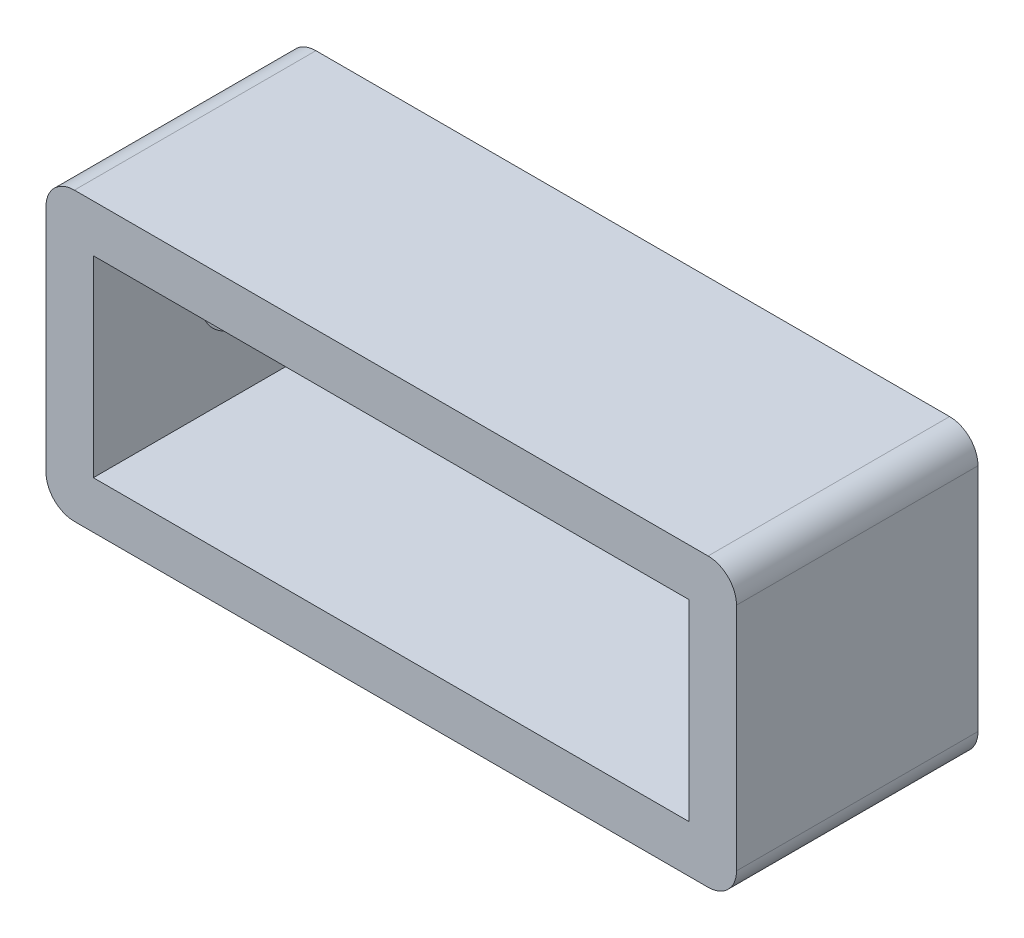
ISO-10303-21;
HEADER;
FILE_DESCRIPTION(('STEP AP214'),'2;1');
FILE_NAME('part.step','',(''),(''),'','','');
FILE_SCHEMA(('AUTOMOTIVE_DESIGN { 1 0 10303 214 1 1 1 1 }'));
ENDSEC;
DATA;
#1=APPLICATION_CONTEXT('core data for automotive mechanical design processes');
#2=APPLICATION_PROTOCOL_DEFINITION('international standard','automotive_design',2000,#1);
#3=PRODUCT_CONTEXT('',#1,'mechanical');
#4=PRODUCT('Part','Part','',(#3));
#5=PRODUCT_RELATED_PRODUCT_CATEGORY('part','',(#4));
#6=PRODUCT_DEFINITION_FORMATION('','',#4);
#7=PRODUCT_DEFINITION_CONTEXT('part definition',#1,'design');
#8=PRODUCT_DEFINITION('design','',#6,#7);
#9=PRODUCT_DEFINITION_SHAPE('','',#8);
#10=(LENGTH_UNIT() NAMED_UNIT(*) SI_UNIT(.MILLI.,.METRE.));
#11=(NAMED_UNIT(*) PLANE_ANGLE_UNIT() SI_UNIT($,.RADIAN.));
#12=(NAMED_UNIT(*) SI_UNIT($,.STERADIAN.) SOLID_ANGLE_UNIT());
#13=UNCERTAINTY_MEASURE_WITH_UNIT(LENGTH_MEASURE(1.E-05),#10,'distance_accuracy_value','');
#14=(GEOMETRIC_REPRESENTATION_CONTEXT(3) GLOBAL_UNCERTAINTY_ASSIGNED_CONTEXT((#13)) GLOBAL_UNIT_ASSIGNED_CONTEXT((#10,
#11,#12)) REPRESENTATION_CONTEXT('',''));
#15=CARTESIAN_POINT('',(0.,0.,0.));
#16=DIRECTION('',(0.,0.,1.));
#17=DIRECTION('',(1.,0.,0.));
#18=AXIS2_PLACEMENT_3D('',#15,#16,#17);
#19=CARTESIAN_POINT('',(33.985001,10.3,-21.));
#20=DIRECTION('',(0.,-1.,0.));
#21=DIRECTION('',(0.,0.,-1.));
#22=AXIS2_PLACEMENT_3D('',#19,#20,#21);
#23=PLANE('',#22);
#24=DIRECTION('',(0.,0.,1.));
#25=VECTOR('',#24,1.);
#26=CARTESIAN_POINT('',(31.985001,10.3,-21.));
#27=LINE('',#26,#25);
#28=CARTESIAN_POINT('',(31.985001,10.3,-24.));
#29=VERTEX_POINT('',#28);
#30=CARTESIAN_POINT('',(31.985001,10.3,0.));
#31=VERTEX_POINT('',#30);
#32=EDGE_CURVE('E221',#29,#31,#27,.T.);
#33=ORIENTED_EDGE('',*,*,#32,.T.);
#34=DIRECTION('',(1.,0.,0.));
#35=VECTOR('',#34,1.);
#36=CARTESIAN_POINT('',(33.985001,10.3,0.));
#37=LINE('',#36,#35);
#38=CARTESIAN_POINT('',(-30.9265875,10.3,0.));
#39=VERTEX_POINT('',#38);
#40=EDGE_CURVE('E226',#39,#31,#37,.T.);
#41=ORIENTED_EDGE('',*,*,#40,.F.);
#42=DIRECTION('',(0.,0.,1.));
#43=VECTOR('',#42,1.);
#44=CARTESIAN_POINT('',(-30.9265875,10.3,-21.));
#45=LINE('',#44,#43);
#46=CARTESIAN_POINT('',(-30.9265875,10.3,-24.));
#47=VERTEX_POINT('',#46);
#48=EDGE_CURVE('E218',#47,#39,#45,.T.);
#49=ORIENTED_EDGE('',*,*,#48,.F.);
#50=DIRECTION('',(1.,0.,0.));
#51=VECTOR('',#50,1.);
#52=CARTESIAN_POINT('',(-30.9265875,10.3,-24.));
#53=LINE('',#52,#51);
#54=EDGE_CURVE('E197',#47,#29,#53,.T.);
#55=ORIENTED_EDGE('',*,*,#54,.T.);
#56=EDGE_LOOP('',(#33,#41,#49,#55));
#57=FACE_BOUND('',#56,.T.);
#58=ADVANCED_FACE('F35',(#57),#23,.T.);
#59=CARTESIAN_POINT('',(31.985001,-58.9988552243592,3.));
#60=DIRECTION('',(1.,0.,0.));
#61=DIRECTION('',(0.,1.,0.));
#62=AXIS2_PLACEMENT_3D('',#59,#60,#61);
#63=PLANE('',#62);
#64=DIRECTION('',(0.,0.,1.));
#65=VECTOR('',#64,1.);
#66=CARTESIAN_POINT('',(31.985001,-10.,-21.));
#67=LINE('',#66,#65);
#68=CARTESIAN_POINT('',(31.985001,-10.,-24.));
#69=VERTEX_POINT('',#68);
#70=CARTESIAN_POINT('',(31.985001,-9.99999999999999,0.));
#71=VERTEX_POINT('',#70);
#72=EDGE_CURVE('E224',#69,#71,#67,.T.);
#73=ORIENTED_EDGE('',*,*,#72,.T.);
#74=DIRECTION('',(0.,1.,0.));
#75=VECTOR('',#74,1.);
#76=CARTESIAN_POINT('',(31.985001,-58.9988552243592,0.));
#77=LINE('',#76,#75);
#78=EDGE_CURVE('E59',#71,#31,#77,.T.);
#79=ORIENTED_EDGE('',*,*,#78,.T.);
#80=ORIENTED_EDGE('',*,*,#32,.F.);
#81=DIRECTION('',(0.,-1.,0.));
#82=VECTOR('',#81,1.);
#83=CARTESIAN_POINT('',(31.985001,10.3,-24.));
#84=LINE('',#83,#82);
#85=EDGE_CURVE('E200',#29,#69,#84,.T.);
#86=ORIENTED_EDGE('',*,*,#85,.T.);
#87=EDGE_LOOP('',(#73,#79,#80,#86));
#88=FACE_BOUND('',#87,.T.);
#89=ADVANCED_FACE('F248',(#88),#63,.F.);
#90=CARTESIAN_POINT('',(0.529206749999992,-10.,3.));
#91=DIRECTION('',(0.,1.,0.));
#92=DIRECTION('',(-1.,0.,0.));
#93=AXIS2_PLACEMENT_3D('',#90,#91,#92);
#94=PLANE('',#93);
#95=DIRECTION('',(0.,0.,1.));
#96=VECTOR('',#95,1.);
#97=CARTESIAN_POINT('',(-30.9265875,-10.,-21.));
#98=LINE('',#97,#96);
#99=CARTESIAN_POINT('',(-30.9265875,-10.,-24.));
#100=VERTEX_POINT('',#99);
#101=CARTESIAN_POINT('',(-30.9265875,-10.,0.));
#102=VERTEX_POINT('',#101);
#103=EDGE_CURVE('E215',#100,#102,#98,.T.);
#104=ORIENTED_EDGE('',*,*,#103,.T.);
#105=DIRECTION('',(-1.,0.,0.));
#106=VECTOR('',#105,1.);
#107=CARTESIAN_POINT('',(-67.7584484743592,-10.,0.));
#108=LINE('',#107,#106);
#109=EDGE_CURVE('E210',#71,#102,#108,.T.);
#110=ORIENTED_EDGE('',*,*,#109,.F.);
#111=ORIENTED_EDGE('',*,*,#72,.F.);
#112=DIRECTION('',(-1.,0.,0.));
#113=VECTOR('',#112,1.);
#114=CARTESIAN_POINT('',(31.985001,-10.,-24.));
#115=LINE('',#114,#113);
#116=EDGE_CURVE('E203',#69,#100,#115,.T.);
#117=ORIENTED_EDGE('',*,*,#116,.T.);
#118=EDGE_LOOP('',(#104,#110,#111,#117));
#119=FACE_BOUND('',#118,.T.);
#120=ADVANCED_FACE('F255',(#119),#94,.T.);
#121=CARTESIAN_POINT('',(36.985001,-58.9988552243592,3.));
#122=DIRECTION('',(1.,0.,0.));
#123=DIRECTION('',(0.,0.,-1.));
#124=AXIS2_PLACEMENT_3D('',#121,#122,#123);
#125=PLANE('',#124);
#126=DIRECTION('',(0.,1.,0.));
#127=VECTOR('',#126,1.);
#128=CARTESIAN_POINT('',(36.985001,9.28880000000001,0.));
#129=LINE('',#128,#127);
#130=CARTESIAN_POINT('',(36.985001,-12.,0.));
#131=VERTEX_POINT('',#130);
#132=CARTESIAN_POINT('',(36.985001,12.3,0.));
#133=VERTEX_POINT('',#132);
#134=EDGE_CURVE('E124',#131,#133,#129,.T.);
#135=ORIENTED_EDGE('',*,*,#134,.F.);
#136=DIRECTION('',(0.,0.,-1.));
#137=VECTOR('',#136,1.);
#138=CARTESIAN_POINT('',(36.985001,-12.,3.));
#139=LINE('',#138,#137);
#140=CARTESIAN_POINT('',(36.985001,-12.,-25.5));
#141=VERTEX_POINT('',#140);
#142=EDGE_CURVE('E135',#131,#141,#139,.T.);
#143=ORIENTED_EDGE('',*,*,#142,.T.);
#144=DIRECTION('',(0.,-1.,0.));
#145=VECTOR('',#144,1.);
#146=CARTESIAN_POINT('',(36.985001,12.3,-25.5));
#147=LINE('',#146,#145);
#148=CARTESIAN_POINT('',(36.985001,12.3,-25.5));
#149=VERTEX_POINT('',#148);
#150=EDGE_CURVE('E188',#149,#141,#147,.T.);
#151=ORIENTED_EDGE('',*,*,#150,.F.);
#152=DIRECTION('',(0.,0.,1.));
#153=VECTOR('',#152,1.);
#154=CARTESIAN_POINT('',(36.985001,12.3,3.));
#155=LINE('',#154,#153);
#156=EDGE_CURVE('E137',#149,#133,#155,.T.);
#157=ORIENTED_EDGE('',*,*,#156,.T.);
#158=EDGE_LOOP('',(#135,#143,#151,#157));
#159=FACE_BOUND('',#158,.T.);
#160=ADVANCED_FACE('F133',(#159),#125,.T.);
#161=CARTESIAN_POINT('',(-35.9265875,-58.9988552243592,3.));
#162=DIRECTION('',(-1.,0.,0.));
#163=DIRECTION('',(0.,0.,1.));
#164=AXIS2_PLACEMENT_3D('',#161,#162,#163);
#165=PLANE('',#164);
#166=DIRECTION('',(0.,-1.,0.));
#167=VECTOR('',#166,1.);
#168=CARTESIAN_POINT('',(-35.9265875,-58.9988552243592,0.));
#169=LINE('',#168,#167);
#170=CARTESIAN_POINT('',(-35.9265875,12.3,0.));
#171=VERTEX_POINT('',#170);
#172=CARTESIAN_POINT('',(-35.9265875,-12.,0.));
#173=VERTEX_POINT('',#172);
#174=EDGE_CURVE('E155',#171,#173,#169,.T.);
#175=ORIENTED_EDGE('',*,*,#174,.F.);
#176=DIRECTION('',(0.,0.,1.));
#177=VECTOR('',#176,1.);
#178=CARTESIAN_POINT('',(-35.9265875,12.3,3.));
#179=LINE('',#178,#177);
#180=CARTESIAN_POINT('',(-35.9265875,12.3,-25.5));
#181=VERTEX_POINT('',#180);
#182=EDGE_CURVE('E142',#171,#181,#179,.F.);
#183=ORIENTED_EDGE('',*,*,#182,.T.);
#184=DIRECTION('',(0.,1.,0.));
#185=VECTOR('',#184,1.);
#186=CARTESIAN_POINT('',(-35.9265875,-12.,-25.5));
#187=LINE('',#186,#185);
#188=CARTESIAN_POINT('',(-35.9265875,-12.,-25.5));
#189=VERTEX_POINT('',#188);
#190=EDGE_CURVE('E178',#189,#181,#187,.T.);
#191=ORIENTED_EDGE('',*,*,#190,.F.);
#192=DIRECTION('',(0.,0.,-1.));
#193=VECTOR('',#192,1.);
#194=CARTESIAN_POINT('',(-35.9265875,-12.,3.));
#195=LINE('',#194,#193);
#196=EDGE_CURVE('E146',#189,#173,#195,.F.);
#197=ORIENTED_EDGE('',*,*,#196,.T.);
#198=EDGE_LOOP('',(#175,#183,#191,#197));
#199=FACE_BOUND('',#198,.T.);
#200=CARTESIAN_POINT('',(-35.9265875,0.535225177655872,-15.80625));
#201=DIRECTION('',(-1.,0.,0.));
#202=DIRECTION('',(0.,0.,1.));
#203=AXIS2_PLACEMENT_3D('',#200,#201,#202);
#204=CIRCLE('',#203,4.5);
#205=CARTESIAN_POINT('',(-35.9265875,0.535225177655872,-11.30625));
#206=VERTEX_POINT('',#205);
#207=EDGE_CURVE('E206',#206,#206,#204,.T.);
#208=ORIENTED_EDGE('',*,*,#207,.F.);
#209=EDGE_LOOP('',(#208));
#210=FACE_BOUND('',#209,.T.);
#211=ADVANCED_FACE('F164',(#199,#210),#165,.T.);
#212=CARTESIAN_POINT('',(0.529206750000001,-15.,3.));
#213=DIRECTION('',(0.,-1.,0.));
#214=DIRECTION('',(1.,0.,0.));
#215=AXIS2_PLACEMENT_3D('',#212,#213,#214);
#216=PLANE('',#215);
#217=DIRECTION('',(1.,0.,0.));
#218=VECTOR('',#217,1.);
#219=CARTESIAN_POINT('',(-40.014999,-15.,0.));
#220=LINE('',#219,#218);
#221=CARTESIAN_POINT('',(-32.9265875,-15.,0.));
#222=VERTEX_POINT('',#221);
#223=CARTESIAN_POINT('',(33.985001,-15.,0.));
#224=VERTEX_POINT('',#223);
#225=EDGE_CURVE('E51',#222,#224,#220,.T.);
#226=ORIENTED_EDGE('',*,*,#225,.F.);
#227=DIRECTION('',(0.,0.,-1.));
#228=VECTOR('',#227,1.);
#229=CARTESIAN_POINT('',(-32.9265875,-15.,3.));
#230=LINE('',#229,#228);
#231=CARTESIAN_POINT('',(-32.9265875,-15.,-25.5));
#232=VERTEX_POINT('',#231);
#233=EDGE_CURVE('E151',#222,#232,#230,.T.);
#234=ORIENTED_EDGE('',*,*,#233,.T.);
#235=DIRECTION('',(-1.,0.,0.));
#236=VECTOR('',#235,1.);
#237=CARTESIAN_POINT('',(33.985001,-15.,-25.5));
#238=LINE('',#237,#236);
#239=CARTESIAN_POINT('',(33.985001,-15.,-25.5));
#240=VERTEX_POINT('',#239);
#241=EDGE_CURVE('E191',#240,#232,#238,.T.);
#242=ORIENTED_EDGE('',*,*,#241,.F.);
#243=DIRECTION('',(0.,0.,-1.));
#244=VECTOR('',#243,1.);
#245=CARTESIAN_POINT('',(33.985001,-15.,3.));
#246=LINE('',#245,#244);
#247=EDGE_CURVE('E144',#240,#224,#246,.F.);
#248=ORIENTED_EDGE('',*,*,#247,.T.);
#249=EDGE_LOOP('',(#226,#234,#242,#248));
#250=FACE_BOUND('',#249,.T.);
#251=ADVANCED_FACE('F264',(#250),#216,.T.);
#252=CARTESIAN_POINT('',(-30.9265875,9.28879999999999,-21.));
#253=DIRECTION('',(-1.,0.,0.));
#254=DIRECTION('',(0.,-1.,0.));
#255=AXIS2_PLACEMENT_3D('',#252,#253,#254);
#256=PLANE('',#255);
#257=CARTESIAN_POINT('',(-30.9265875,0.535225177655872,-15.80625));
#258=DIRECTION('',(-1.,0.,0.));
#259=DIRECTION('',(0.,-1.,0.));
#260=AXIS2_PLACEMENT_3D('',#257,#258,#259);
#261=CIRCLE('',#260,4.5);
#262=CARTESIAN_POINT('',(-30.9265875,-3.96477482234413,-15.80625));
#263=VERTEX_POINT('',#262);
#264=EDGE_CURVE('E39',#263,#263,#261,.T.);
#265=ORIENTED_EDGE('',*,*,#264,.T.);
#266=EDGE_LOOP('',(#265));
#267=FACE_BOUND('',#266,.T.);
#268=DIRECTION('',(0.,-1.,0.));
#269=VECTOR('',#268,1.);
#270=CARTESIAN_POINT('',(-30.9265875,9.28879999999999,0.));
#271=LINE('',#270,#269);
#272=EDGE_CURVE('E212',#39,#102,#271,.T.);
#273=ORIENTED_EDGE('',*,*,#272,.T.);
#274=ORIENTED_EDGE('',*,*,#103,.F.);
#275=DIRECTION('',(0.,1.,0.));
#276=VECTOR('',#275,1.);
#277=CARTESIAN_POINT('',(-30.9265875,10.3,-24.));
#278=LINE('',#277,#276);
#279=EDGE_CURVE('E194',#100,#47,#278,.T.);
#280=ORIENTED_EDGE('',*,*,#279,.T.);
#281=ORIENTED_EDGE('',*,*,#48,.T.);
#282=EDGE_LOOP('',(#273,#274,#280,#281));
#283=FACE_BOUND('',#282,.T.);
#284=ADVANCED_FACE('F267',(#267,#283),#256,.F.);
#285=CARTESIAN_POINT('',(-67.7584484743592,15.3,-21.));
#286=DIRECTION('',(0.,1.,0.));
#287=DIRECTION('',(0.,0.,1.));
#288=AXIS2_PLACEMENT_3D('',#285,#286,#287);
#289=PLANE('',#288);
#290=DIRECTION('',(0.,0.,1.));
#291=VECTOR('',#290,1.);
#292=CARTESIAN_POINT('',(33.985001,15.3,-21.));
#293=LINE('',#292,#291);
#294=CARTESIAN_POINT('',(33.985001,15.3,0.));
#295=VERTEX_POINT('',#294);
#296=CARTESIAN_POINT('',(33.985001,15.3,-25.5));
#297=VERTEX_POINT('',#296);
#298=EDGE_CURVE('E228',#295,#297,#293,.F.);
#299=ORIENTED_EDGE('',*,*,#298,.T.);
#300=DIRECTION('',(1.,0.,0.));
#301=VECTOR('',#300,1.);
#302=CARTESIAN_POINT('',(-32.9265875,15.3,-25.5));
#303=LINE('',#302,#301);
#304=CARTESIAN_POINT('',(-32.9265875,15.3,-25.5));
#305=VERTEX_POINT('',#304);
#306=EDGE_CURVE('E177',#305,#297,#303,.T.);
#307=ORIENTED_EDGE('',*,*,#306,.F.);
#308=DIRECTION('',(0.,0.,1.));
#309=VECTOR('',#308,1.);
#310=CARTESIAN_POINT('',(-32.9265875,15.3,-21.));
#311=LINE('',#310,#309);
#312=CARTESIAN_POINT('',(-32.9265875,15.3,0.));
#313=VERTEX_POINT('',#312);
#314=EDGE_CURVE('E173',#305,#313,#311,.T.);
#315=ORIENTED_EDGE('',*,*,#314,.T.);
#316=DIRECTION('',(-1.,0.,0.));
#317=VECTOR('',#316,1.);
#318=CARTESIAN_POINT('',(-67.7584484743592,15.3,0.));
#319=LINE('',#318,#317);
#320=EDGE_CURVE('E158',#295,#313,#319,.T.);
#321=ORIENTED_EDGE('',*,*,#320,.F.);
#322=EDGE_LOOP('',(#299,#307,#315,#321));
#323=FACE_BOUND('',#322,.T.);
#324=ADVANCED_FACE('F231',(#323),#289,.T.);
#325=CARTESIAN_POINT('',(-32.9265875,12.3,-21.));
#326=DIRECTION('',(0.,0.,1.));
#327=DIRECTION('',(1.,0.,0.));
#328=AXIS2_PLACEMENT_3D('',#325,#326,#327);
#329=CYLINDRICAL_SURFACE('',#328,3.);
#330=ORIENTED_EDGE('',*,*,#314,.F.);
#331=CARTESIAN_POINT('',(-32.9265875,12.3,-25.5));
#332=DIRECTION('',(0.,0.,-1.));
#333=DIRECTION('',(-1.,0.,0.));
#334=AXIS2_PLACEMENT_3D('',#331,#332,#333);
#335=CIRCLE('',#334,3.00000000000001);
#336=EDGE_CURVE('E172',#181,#305,#335,.T.);
#337=ORIENTED_EDGE('',*,*,#336,.F.);
#338=ORIENTED_EDGE('',*,*,#182,.F.);
#339=CARTESIAN_POINT('',(-32.9265875,12.3,0.));
#340=DIRECTION('',(0.,0.,1.));
#341=DIRECTION('',(1.,0.,0.));
#342=AXIS2_PLACEMENT_3D('',#339,#340,#341);
#343=CIRCLE('',#342,3.);
#344=EDGE_CURVE('E44',#313,#171,#343,.T.);
#345=ORIENTED_EDGE('',*,*,#344,.F.);
#346=EDGE_LOOP('',(#330,#337,#338,#345));
#347=FACE_BOUND('',#346,.T.);
#348=ADVANCED_FACE('F170',(#347),#329,.T.);
#349=CARTESIAN_POINT('',(33.985001,12.3,3.));
#350=DIRECTION('',(0.,0.,1.));
#351=DIRECTION('',(1.,0.,0.));
#352=AXIS2_PLACEMENT_3D('',#349,#350,#351);
#353=CYLINDRICAL_SURFACE('',#352,3.);
#354=ORIENTED_EDGE('',*,*,#156,.F.);
#355=CARTESIAN_POINT('',(33.985001,12.3,-25.5));
#356=DIRECTION('',(0.,0.,-1.));
#357=DIRECTION('',(-1.,0.,0.));
#358=AXIS2_PLACEMENT_3D('',#355,#356,#357);
#359=CIRCLE('',#358,3.);
#360=EDGE_CURVE('E180',#297,#149,#359,.T.);
#361=ORIENTED_EDGE('',*,*,#360,.F.);
#362=ORIENTED_EDGE('',*,*,#298,.F.);
#363=CARTESIAN_POINT('',(33.985001,12.3,0.));
#364=DIRECTION('',(0.,0.,1.));
#365=DIRECTION('',(1.,0.,0.));
#366=AXIS2_PLACEMENT_3D('',#363,#364,#365);
#367=CIRCLE('',#366,3.);
#368=EDGE_CURVE('E11',#133,#295,#367,.T.);
#369=ORIENTED_EDGE('',*,*,#368,.F.);
#370=EDGE_LOOP('',(#354,#361,#362,#369));
#371=FACE_BOUND('',#370,.T.);
#372=ADVANCED_FACE('F237',(#371),#353,.T.);
#373=CARTESIAN_POINT('',(-32.9265875,-12.,3.));
#374=DIRECTION('',(0.,0.,-1.));
#375=DIRECTION('',(-1.,0.,0.));
#376=AXIS2_PLACEMENT_3D('',#373,#374,#375);
#377=CYLINDRICAL_SURFACE('',#376,3.);
#378=CARTESIAN_POINT('',(-32.9265875,-12.,0.));
#379=DIRECTION('',(0.,0.,-1.));
#380=DIRECTION('',(-1.,0.,0.));
#381=AXIS2_PLACEMENT_3D('',#378,#379,#380);
#382=CIRCLE('',#381,3.);
#383=EDGE_CURVE('E129',#173,#222,#382,.F.);
#384=ORIENTED_EDGE('',*,*,#383,.F.);
#385=ORIENTED_EDGE('',*,*,#196,.F.);
#386=CARTESIAN_POINT('',(-32.9265875,-12.,-25.5));
#387=DIRECTION('',(0.,0.,-1.));
#388=DIRECTION('',(-1.,0.,0.));
#389=AXIS2_PLACEMENT_3D('',#386,#387,#388);
#390=CIRCLE('',#389,3.);
#391=EDGE_CURVE('E182',#232,#189,#390,.T.);
#392=ORIENTED_EDGE('',*,*,#391,.F.);
#393=ORIENTED_EDGE('',*,*,#233,.F.);
#394=EDGE_LOOP('',(#384,#385,#392,#393));
#395=FACE_BOUND('',#394,.T.);
#396=ADVANCED_FACE('F239',(#395),#377,.T.);
#397=CARTESIAN_POINT('',(33.985001,-12.,3.));
#398=DIRECTION('',(0.,0.,-1.));
#399=DIRECTION('',(-1.,0.,0.));
#400=AXIS2_PLACEMENT_3D('',#397,#398,#399);
#401=CYLINDRICAL_SURFACE('',#400,3.);
#402=CARTESIAN_POINT('',(33.985001,-12.,0.));
#403=DIRECTION('',(0.,0.,-1.));
#404=DIRECTION('',(-1.,0.,0.));
#405=AXIS2_PLACEMENT_3D('',#402,#403,#404);
#406=CIRCLE('',#405,3.);
#407=EDGE_CURVE('E121',#224,#131,#406,.F.);
#408=ORIENTED_EDGE('',*,*,#407,.F.);
#409=ORIENTED_EDGE('',*,*,#247,.F.);
#410=CARTESIAN_POINT('',(33.985001,-12.,-25.5));
#411=DIRECTION('',(0.,0.,-1.));
#412=DIRECTION('',(-1.,0.,0.));
#413=AXIS2_PLACEMENT_3D('',#410,#411,#412);
#414=CIRCLE('',#413,3.);
#415=EDGE_CURVE('E141',#141,#240,#414,.T.);
#416=ORIENTED_EDGE('',*,*,#415,.F.);
#417=ORIENTED_EDGE('',*,*,#142,.F.);
#418=EDGE_LOOP('',(#408,#409,#416,#417));
#419=FACE_BOUND('',#418,.T.);
#420=ADVANCED_FACE('F37',(#419),#401,.T.);
#421=CARTESIAN_POINT('',(-25.9265875,0.535225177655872,-15.80625));
#422=DIRECTION('',(-1.,0.,0.));
#423=DIRECTION('',(0.,0.,1.));
#424=AXIS2_PLACEMENT_3D('',#421,#422,#423);
#425=CYLINDRICAL_SURFACE('',#424,4.5);
#426=ORIENTED_EDGE('',*,*,#207,.T.);
#427=EDGE_LOOP('',(#426));
#428=FACE_BOUND('',#427,.T.);
#429=ORIENTED_EDGE('',*,*,#264,.F.);
#430=EDGE_LOOP('',(#429));
#431=FACE_BOUND('',#430,.T.);
#432=ADVANCED_FACE('F321',(#428,#431),#425,.F.);
#433=CARTESIAN_POINT('',(-32.9265875,-12.,-25.5));
#434=DIRECTION('',(0.,0.,-1.));
#435=DIRECTION('',(-1.,0.,0.));
#436=AXIS2_PLACEMENT_3D('',#433,#434,#435);
#437=PLANE('',#436);
#438=ORIENTED_EDGE('',*,*,#391,.T.);
#439=ORIENTED_EDGE('',*,*,#190,.T.);
#440=ORIENTED_EDGE('',*,*,#336,.T.);
#441=ORIENTED_EDGE('',*,*,#306,.T.);
#442=ORIENTED_EDGE('',*,*,#360,.T.);
#443=ORIENTED_EDGE('',*,*,#150,.T.);
#444=ORIENTED_EDGE('',*,*,#415,.T.);
#445=ORIENTED_EDGE('',*,*,#241,.T.);
#446=EDGE_LOOP('',(#438,#439,#440,#441,#442,#443,#444,#445));
#447=FACE_BOUND('',#446,.T.);
#448=ADVANCED_FACE('F235',(#447),#437,.T.);
#449=CARTESIAN_POINT('',(-32.9265875,-12.,-24.));
#450=DIRECTION('',(0.,0.,-1.));
#451=DIRECTION('',(-1.,0.,0.));
#452=AXIS2_PLACEMENT_3D('',#449,#450,#451);
#453=PLANE('',#452);
#454=ORIENTED_EDGE('',*,*,#54,.F.);
#455=ORIENTED_EDGE('',*,*,#279,.F.);
#456=ORIENTED_EDGE('',*,*,#116,.F.);
#457=ORIENTED_EDGE('',*,*,#85,.F.);
#458=EDGE_LOOP('',(#454,#455,#456,#457));
#459=FACE_BOUND('',#458,.T.);
#460=ADVANCED_FACE('F338',(#459),#453,.F.);
#461=CARTESIAN_POINT('',(-40.014999,9.28880000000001,0.));
#462=DIRECTION('',(0.,0.,-1.));
#463=DIRECTION('',(-1.,0.,0.));
#464=AXIS2_PLACEMENT_3D('',#461,#462,#463);
#465=PLANE('',#464);
#466=ORIENTED_EDGE('',*,*,#174,.T.);
#467=ORIENTED_EDGE('',*,*,#383,.T.);
#468=ORIENTED_EDGE('',*,*,#225,.T.);
#469=ORIENTED_EDGE('',*,*,#407,.T.);
#470=ORIENTED_EDGE('',*,*,#134,.T.);
#471=ORIENTED_EDGE('',*,*,#368,.T.);
#472=ORIENTED_EDGE('',*,*,#320,.T.);
#473=ORIENTED_EDGE('',*,*,#344,.T.);
#474=EDGE_LOOP('',(#466,#467,#468,#469,#470,#471,#472,#473));
#475=FACE_BOUND('',#474,.T.);
#476=ORIENTED_EDGE('',*,*,#109,.T.);
#477=ORIENTED_EDGE('',*,*,#272,.F.);
#478=ORIENTED_EDGE('',*,*,#40,.T.);
#479=ORIENTED_EDGE('',*,*,#78,.F.);
#480=EDGE_LOOP('',(#476,#477,#478,#479));
#481=FACE_BOUND('',#480,.T.);
#482=ADVANCED_FACE('F123',(#475,#481),#465,.F.);
#483=CLOSED_SHELL('',(#58,#89,#120,#160,#211,#251,#284,#324,#348,#372,#396,#420,#432,#448,#460,#482));
#484=MANIFOLD_SOLID_BREP('B2',#483);
#485=ADVANCED_BREP_SHAPE_REPRESENTATION('',(#18,#484),#14);
#486=SHAPE_DEFINITION_REPRESENTATION(#9,#485);
ENDSEC;
END-ISO-10303-21;
